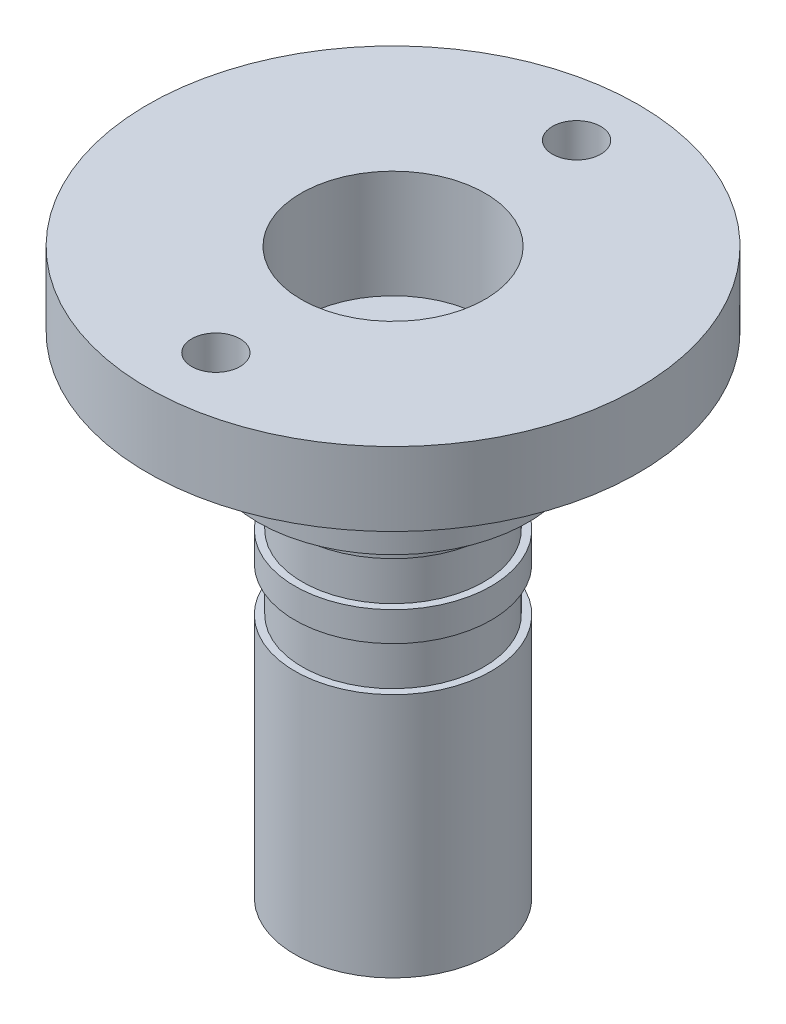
from build123d import *

# Parameters (mm, degrees)
M2_CLEARANCE_HOLE1_D = 2.499868
HOLE1_D              = 5.08
HOLE1_CBORE_D        = 9.525
HOLE1_CBORE_DEPTH    = 5.588


with BuildPart() as part:
    # Sketch1 → Revolve1 (revolve)
    with BuildSketch(Plane.XY, mode=Mode.PRIVATE) as revolve1_sk:
        Polygon((12.7, 16.51), (0, 16.51), (0, -12.7), (5.08, -12.7), (5.08, 0), (4.699, 0), (4.699, 2.286), (5.08, 2.286), (5.08, 3.81), (4.699, 3.81), (4.699, 6.096), (5.08, 6.096), (5.08, 7.62), (6.985, 7.62), (6.985, 12.7), (12.7, 12.7), align=None)
    revolve(revolve1_sk.sketch.rotate(Axis((0, 16.51, 0), (0, -1, 0)), 270), axis=Axis((0, 16.51, 0), (0, -1, 0)))

    # M2 Clearance Hole1 (through all)
    with Locations(Plane(origin=(0, 12.7, 0), x_dir=(-1, 0, 0), z_dir=(0, -1, 0))):
        with Locations((-0.185052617, -9.356227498), (0, 9.4996)):
            Hole(M2_CLEARANCE_HOLE1_D / 2)

    # Hole1 (through all)
    with Locations(Plane(origin=(0, 16.51, 0), x_dir=(1, 0, 0), z_dir=(0, 1, 0))):
        with Locations((0, 0)):
            CounterBoreHole(HOLE1_D / 2, HOLE1_CBORE_D / 2, HOLE1_CBORE_DEPTH)


solid = part.part
